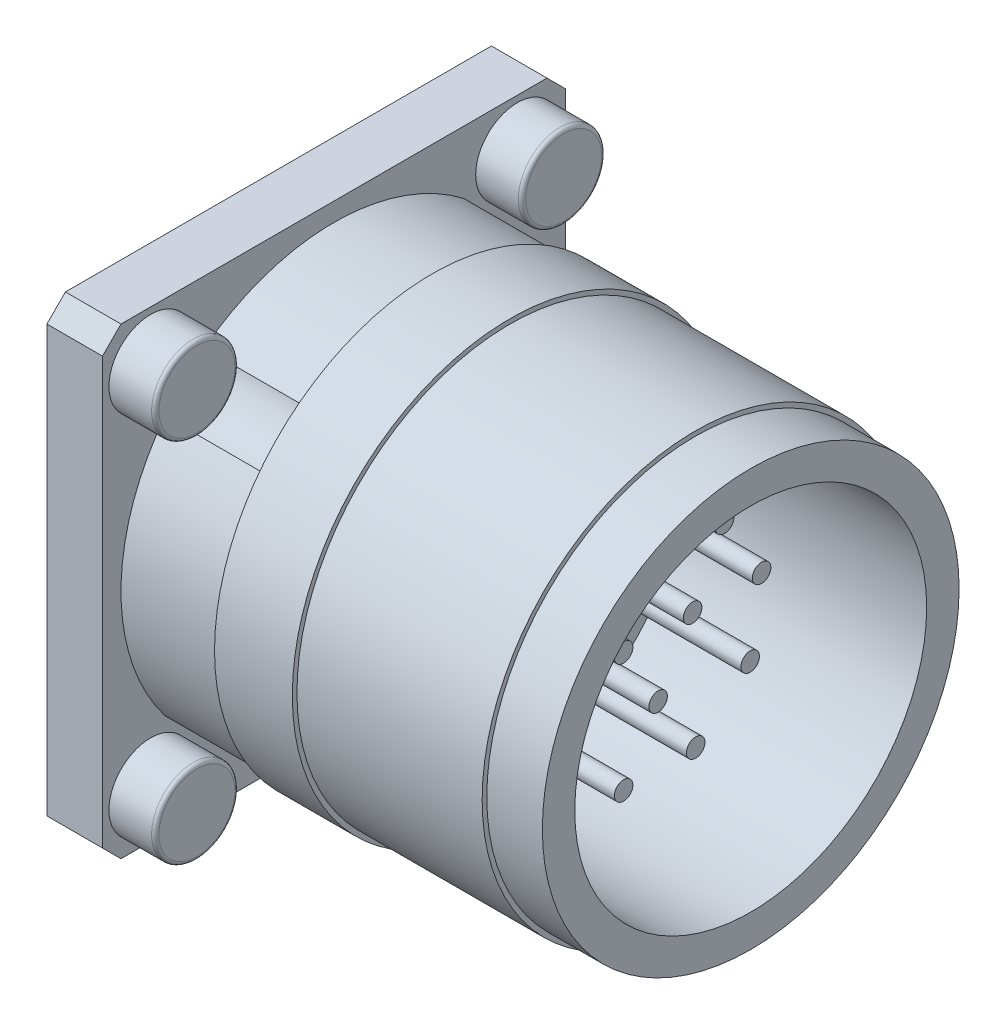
from build123d import *

# Parameters (mm, degrees)
EXTRUSION1_DEPTH        = 3
ENL_V_START             = 5.3
ESQUISSE3_R             = 15
ENL_V_MAT_EXTRU_1_DEPTH = 5.3
ENL_V_START_2           = -13
ESQUISSE8_R             = 9.5
ESQUISSE8_R_2           = 0.5
ENL_V_MAT_EXTRU_2_DEPTH = 13


with BuildPart() as part:
    # Esquisse1 → Extrusion1 (new body)
    with BuildSketch(Plane(origin=(0, 0, 0), x_dir=(0, 0, -1), z_dir=(1, 0, 0))):
        Polygon((-12.5, 11.5), (-12.5, -11.5), (-11.5, -12.5), (11.5, -12.5), (12.5, -11.5), (12.5, 11.5), (11.5, 12.5), (-11.5, 12.5), align=None)
    extrude(amount=EXTRUSION1_DEPTH)

    # Esquisse2 → R_volution1 (revolve)
    with BuildSketch(Plane.XY, mode=Mode.PRIVATE) as r_volution1_sk:
        Polygon((0, 0), (0, 11.75), (12.5, 11.75), (12.5, 11.5), (22.5, 11.5), (22.5, 11.25), (25.5, 11.25), (25.5, 9.5), (20.5, 9.5), (20.5, 0), align=None)
    revolve(r_volution1_sk.sketch.rotate(Axis((20.5, 0, 0), (-1, 0, 0)), 270), axis=Axis((20.5, 0, 0), (-1, 0, 0)))

    # Esquisse3 → Enl_v. mat.-Extru.1 (cut)
    with BuildSketch(Plane(origin=(3, 0, 0), x_dir=(0, 0, -1), z_dir=(1, 0, 0)).offset(ENL_V_START)):
        Circle(ESQUISSE3_R)
        with BuildLine():
            ThreePointArc((-9.122151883, 7.002595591), (-11.5, 0), (-9.122151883, -7.002595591))
            ThreePointArc((-9.122151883, -7.002595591), (-7.778679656, -7.778679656), (-7.002595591, -9.122151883))
            ThreePointArc((-7.002595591, -9.122151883), (0, -11.5), (7.002595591, -9.122151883))
            ThreePointArc((7.002595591, -9.122151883), (7.778679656, -7.778679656), (9.122151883, -7.002595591))
            ThreePointArc((9.122151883, -7.002595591), (11.5, 0), (9.122151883, 7.002595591))
            ThreePointArc((9.122151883, 7.002595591), (7.778679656, 7.778679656), (7.002595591, 9.122151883))
            ThreePointArc((7.002595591, 9.122151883), (0, 11.5), (-7.002595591, 9.122151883))
            ThreePointArc((-7.002595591, 9.122151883), (-7.778679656, 7.778679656), (-9.122151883, 7.002595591))
        make_face(mode=Mode.SUBTRACT)
    extrude(amount=-ENL_V_MAT_EXTRU_1_DEPTH, mode=Mode.SUBTRACT)

    # Esquisse4 → R_volution2 (revolve)
    with BuildSketch(Plane.XY.offset(9.9), mode=Mode.PRIVATE) as r_volution2_sk:
        with BuildLine():
            Line((3, 9.9), (3, 12.15))
            Line((3, 12.15), (5.3, 12.15))
            ThreePointArc((5.3, 12.15), (5.441421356, 12.091421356), (5.5, 11.95))
            Line((5.5, 11.95), (5.5, 9.9))
            Line((5.5, 9.9), (3, 9.9))
        make_face()
    revolve(r_volution2_sk.sketch.rotate(Axis((5.5, 9.9, 9.9), (-1, 0, 0)), 270), axis=Axis((5.5, 9.9, 9.9), (-1, 0, 0)))

    # Esquisse5 → R_volution3 (revolve)
    with BuildSketch(Plane.XY.offset(9.9), mode=Mode.PRIVATE) as r_volution3_sk:
        with BuildLine():
            Line((3, -9.9), (3, -7.65))
            Line((3, -7.65), (5.3, -7.65))
            ThreePointArc((5.3, -7.65), (5.441421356, -7.708578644), (5.5, -7.85))
            Line((5.5, -7.85), (5.5, -9.9))
            Line((5.5, -9.9), (3, -9.9))
        make_face()
    revolve(r_volution3_sk.sketch.rotate(Axis((5.5, -9.9, 9.9), (-1, 0, 0)), 270), axis=Axis((5.5, -9.9, 9.9), (-1, 0, 0)))

    # Esquisse6 → R_volution4 (revolve)
    with BuildSketch(Plane.XY.offset(-9.9), mode=Mode.PRIVATE) as r_volution4_sk:
        with BuildLine():
            Line((3, 9.9), (3, 12.15))
            Line((3, 12.15), (5.3, 12.15))
            ThreePointArc((5.3, 12.15), (5.441421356, 12.091421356), (5.5, 11.95))
            Line((5.5, 11.95), (5.5, 9.9))
            Line((5.5, 9.9), (3, 9.9))
        make_face()
    revolve(r_volution4_sk.sketch.rotate(Axis((5.5, 9.9, -9.9), (-1, 0, 0)), 270), axis=Axis((5.5, 9.9, -9.9), (-1, 0, 0)))

    # Esquisse7 → R_volution5 (revolve)
    with BuildSketch(Plane.XY.offset(-9.9), mode=Mode.PRIVATE) as r_volution5_sk:
        with BuildLine():
            Line((3, -9.9), (3, -7.65))
            Line((3, -7.65), (5.3, -7.65))
            ThreePointArc((5.3, -7.65), (5.441421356, -7.708578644), (5.5, -7.85))
            Line((5.5, -7.85), (5.5, -9.9))
            Line((5.5, -9.9), (3, -9.9))
        make_face()
    revolve(r_volution5_sk.sketch.rotate(Axis((5.5, -9.9, -9.9), (-1, 0, 0)), 270), axis=Axis((5.5, -9.9, -9.9), (-1, 0, 0)))

    # Esquisse8 → Enl_v. mat.-Extru.2 (cut)
    with BuildSketch(Plane(origin=(25.5, 0, 0), x_dir=(0, 0, -1), z_dir=(1, 0, 0)).offset(ENL_V_START_2)):
        with Locations(Location((0, 0, 0), (0, 0, 180))):
            Circle(ESQUISSE8_R)
        with Locations((5.585863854, 1.075)):
            Circle(ESQUISSE8_R_2, mode=Mode.SUBTRACT)
        with Locations((4.970016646, -2.767026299)):
            Circle(ESQUISSE8_R_2, mode=Mode.SUBTRACT)
        with Locations((3.588023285, 4.414021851)):
            Circle(ESQUISSE8_R_2, mode=Mode.SUBTRACT)
        with Locations((2.028643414, -5.31433024)):
            Circle(ESQUISSE8_R_2, mode=Mode.SUBTRACT)
        with Locations((1.861954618, 1.075)):
            Circle(ESQUISSE8_R_2, mode=Mode.SUBTRACT)
        with Locations((0, 4.3)):
            Circle(ESQUISSE8_R_2, mode=Mode.SUBTRACT)
        with Locations((0, -2.15)):
            Circle(ESQUISSE8_R_2, mode=Mode.SUBTRACT)
        with Locations((-1.861954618, 1.075)):
            Circle(ESQUISSE8_R_2, mode=Mode.SUBTRACT)
        with Locations((-1.861954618, -5.375)):
            Circle(ESQUISSE8_R_2, mode=Mode.SUBTRACT)
        with Locations((-3.723909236, 4.3)):
            Circle(ESQUISSE8_R_2, mode=Mode.SUBTRACT)
        with Locations((-4.881323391, -2.920647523)):
            Circle(ESQUISSE8_R_2, mode=Mode.SUBTRACT)
        with Locations((-5.616666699, 0.900308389)):
            Circle(ESQUISSE8_R_2, mode=Mode.SUBTRACT)
    extrude(amount=ENL_V_MAT_EXTRU_2_DEPTH, mode=Mode.SUBTRACT)


solid = part.part
